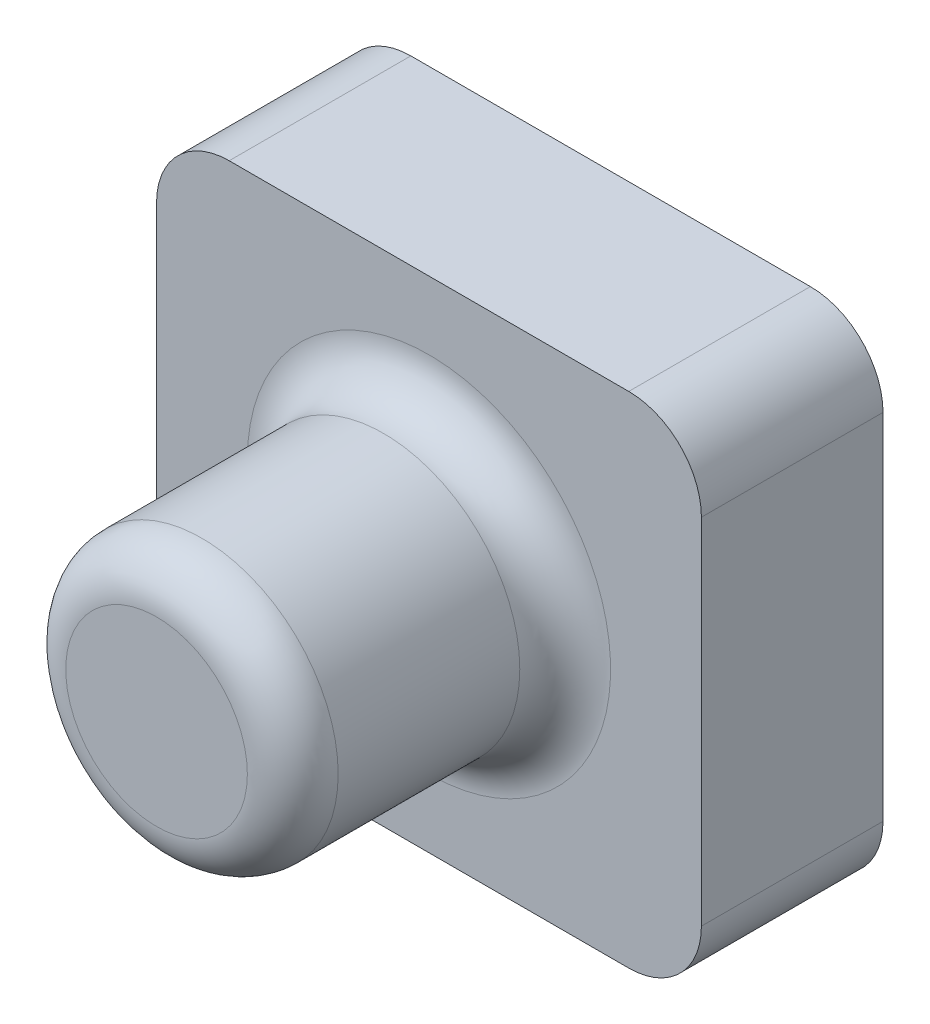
ISO-10303-21;
HEADER;
FILE_DESCRIPTION(('STEP AP214'),'2;1');
FILE_NAME('part.step','',(''),(''),'','','');
FILE_SCHEMA(('AUTOMOTIVE_DESIGN { 1 0 10303 214 1 1 1 1 }'));
ENDSEC;
DATA;
#1=APPLICATION_CONTEXT('core data for automotive mechanical design processes');
#2=APPLICATION_PROTOCOL_DEFINITION('international standard','automotive_design',2000,#1);
#3=PRODUCT_CONTEXT('',#1,'mechanical');
#4=PRODUCT('Part','Part','',(#3));
#5=PRODUCT_RELATED_PRODUCT_CATEGORY('part','',(#4));
#6=PRODUCT_DEFINITION_FORMATION('','',#4);
#7=PRODUCT_DEFINITION_CONTEXT('part definition',#1,'design');
#8=PRODUCT_DEFINITION('design','',#6,#7);
#9=PRODUCT_DEFINITION_SHAPE('','',#8);
#10=(LENGTH_UNIT() NAMED_UNIT(*) SI_UNIT(.MILLI.,.METRE.));
#11=(NAMED_UNIT(*) PLANE_ANGLE_UNIT() SI_UNIT($,.RADIAN.));
#12=(NAMED_UNIT(*) SI_UNIT($,.STERADIAN.) SOLID_ANGLE_UNIT());
#13=UNCERTAINTY_MEASURE_WITH_UNIT(LENGTH_MEASURE(1.E-05),#10,'distance_accuracy_value','');
#14=(GEOMETRIC_REPRESENTATION_CONTEXT(3) GLOBAL_UNCERTAINTY_ASSIGNED_CONTEXT((#13)) GLOBAL_UNIT_ASSIGNED_CONTEXT((#10,
#11,#12)) REPRESENTATION_CONTEXT('',''));
#15=CARTESIAN_POINT('',(0.,0.,0.));
#16=DIRECTION('',(0.,0.,1.));
#17=DIRECTION('',(1.,0.,0.));
#18=AXIS2_PLACEMENT_3D('',#15,#16,#17);
#19=CARTESIAN_POINT('',(0.,55.,0.));
#20=DIRECTION('',(0.,0.,-1.));
#21=DIRECTION('',(-1.,0.,0.));
#22=AXIS2_PLACEMENT_3D('',#19,#20,#21);
#23=PLANE('',#22);
#24=DIRECTION('',(1.,0.,0.));
#25=VECTOR('',#24,1.);
#26=CARTESIAN_POINT('',(0.,0.,0.));
#27=LINE('',#26,#25);
#28=CARTESIAN_POINT('',(8.,0.,0.));
#29=VERTEX_POINT('',#28);
#30=CARTESIAN_POINT('',(52.,0.,0.));
#31=VERTEX_POINT('',#30);
#32=EDGE_CURVE('E233',#29,#31,#27,.T.);
#33=ORIENTED_EDGE('',*,*,#32,.F.);
#34=CARTESIAN_POINT('',(8.,8.,0.));
#35=DIRECTION('',(0.,0.,-1.));
#36=DIRECTION('',(-1.,0.,0.));
#37=AXIS2_PLACEMENT_3D('',#34,#35,#36);
#38=CIRCLE('',#37,8.);
#39=CARTESIAN_POINT('',(0.,8.,0.));
#40=VERTEX_POINT('',#39);
#41=EDGE_CURVE('E250',#29,#40,#38,.T.);
#42=ORIENTED_EDGE('',*,*,#41,.T.);
#43=DIRECTION('',(0.,-1.,0.));
#44=VECTOR('',#43,1.);
#45=CARTESIAN_POINT('',(0.,0.,0.));
#46=LINE('',#45,#44);
#47=CARTESIAN_POINT('',(0.,47.,0.));
#48=VERTEX_POINT('',#47);
#49=EDGE_CURVE('E204',#48,#40,#46,.T.);
#50=ORIENTED_EDGE('',*,*,#49,.F.);
#51=CARTESIAN_POINT('',(8.,47.,0.));
#52=DIRECTION('',(0.,0.,-1.));
#53=DIRECTION('',(-1.,0.,0.));
#54=AXIS2_PLACEMENT_3D('',#51,#52,#53);
#55=CIRCLE('',#54,8.);
#56=CARTESIAN_POINT('',(8.,55.,0.));
#57=VERTEX_POINT('',#56);
#58=EDGE_CURVE('E244',#48,#57,#55,.T.);
#59=ORIENTED_EDGE('',*,*,#58,.T.);
#60=DIRECTION('',(-1.,0.,0.));
#61=VECTOR('',#60,1.);
#62=CARTESIAN_POINT('',(0.,55.,0.));
#63=LINE('',#62,#61);
#64=CARTESIAN_POINT('',(52.,55.,0.));
#65=VERTEX_POINT('',#64);
#66=EDGE_CURVE('E222',#65,#57,#63,.T.);
#67=ORIENTED_EDGE('',*,*,#66,.F.);
#68=CARTESIAN_POINT('',(52.,47.,0.));
#69=DIRECTION('',(0.,0.,-1.));
#70=DIRECTION('',(-1.,0.,0.));
#71=AXIS2_PLACEMENT_3D('',#68,#69,#70);
#72=CIRCLE('',#71,8.);
#73=CARTESIAN_POINT('',(60.,47.,0.));
#74=VERTEX_POINT('',#73);
#75=EDGE_CURVE('E246',#65,#74,#72,.T.);
#76=ORIENTED_EDGE('',*,*,#75,.T.);
#77=DIRECTION('',(0.,1.,0.));
#78=VECTOR('',#77,1.);
#79=CARTESIAN_POINT('',(60.,0.,0.));
#80=LINE('',#79,#78);
#81=CARTESIAN_POINT('',(60.,8.,0.));
#82=VERTEX_POINT('',#81);
#83=EDGE_CURVE('E236',#82,#74,#80,.T.);
#84=ORIENTED_EDGE('',*,*,#83,.F.);
#85=CARTESIAN_POINT('',(52.,8.,0.));
#86=DIRECTION('',(0.,0.,-1.));
#87=DIRECTION('',(-1.,0.,0.));
#88=AXIS2_PLACEMENT_3D('',#85,#86,#87);
#89=CIRCLE('',#88,8.);
#90=EDGE_CURVE('E248',#82,#31,#89,.T.);
#91=ORIENTED_EDGE('',*,*,#90,.T.);
#92=EDGE_LOOP('',(#33,#42,#50,#59,#67,#76,#84,#91));
#93=FACE_BOUND('',#92,.T.);
#94=CARTESIAN_POINT('',(8.,8.,0.));
#95=DIRECTION('',(0.,0.,-1.));
#96=DIRECTION('',(-1.,0.,0.));
#97=AXIS2_PLACEMENT_3D('',#94,#95,#96);
#98=CIRCLE('',#97,5.);
#99=CARTESIAN_POINT('',(8.,3.,0.));
#100=VERTEX_POINT('',#99);
#101=CARTESIAN_POINT('',(3.,8.,0.));
#102=VERTEX_POINT('',#101);
#103=EDGE_CURVE('E215',#100,#102,#98,.T.);
#104=ORIENTED_EDGE('',*,*,#103,.F.);
#105=DIRECTION('',(1.,0.,0.));
#106=VECTOR('',#105,1.);
#107=CARTESIAN_POINT('',(0.,3.,0.));
#108=LINE('',#107,#106);
#109=CARTESIAN_POINT('',(52.,3.,0.));
#110=VERTEX_POINT('',#109);
#111=EDGE_CURVE('E174',#100,#110,#108,.T.);
#112=ORIENTED_EDGE('',*,*,#111,.T.);
#113=CARTESIAN_POINT('',(52.,8.,0.));
#114=DIRECTION('',(0.,0.,-1.));
#115=DIRECTION('',(-1.,0.,0.));
#116=AXIS2_PLACEMENT_3D('',#113,#114,#115);
#117=CIRCLE('',#116,5.);
#118=CARTESIAN_POINT('',(57.,8.,0.));
#119=VERTEX_POINT('',#118);
#120=EDGE_CURVE('E212',#119,#110,#117,.T.);
#121=ORIENTED_EDGE('',*,*,#120,.F.);
#122=DIRECTION('',(0.,1.,0.));
#123=VECTOR('',#122,1.);
#124=CARTESIAN_POINT('',(57.,55.,0.));
#125=LINE('',#124,#123);
#126=CARTESIAN_POINT('',(57.,47.,0.));
#127=VERTEX_POINT('',#126);
#128=EDGE_CURVE('E47',#119,#127,#125,.T.);
#129=ORIENTED_EDGE('',*,*,#128,.T.);
#130=CARTESIAN_POINT('',(52.,47.,0.));
#131=DIRECTION('',(0.,0.,-1.));
#132=DIRECTION('',(-1.,0.,0.));
#133=AXIS2_PLACEMENT_3D('',#130,#131,#132);
#134=CIRCLE('',#133,5.);
#135=CARTESIAN_POINT('',(52.,52.,0.));
#136=VERTEX_POINT('',#135);
#137=EDGE_CURVE('E179',#136,#127,#134,.T.);
#138=ORIENTED_EDGE('',*,*,#137,.F.);
#139=DIRECTION('',(-1.,0.,0.));
#140=VECTOR('',#139,1.);
#141=CARTESIAN_POINT('',(0.,52.,0.));
#142=LINE('',#141,#140);
#143=CARTESIAN_POINT('',(8.,52.,0.));
#144=VERTEX_POINT('',#143);
#145=EDGE_CURVE('E208',#136,#144,#142,.T.);
#146=ORIENTED_EDGE('',*,*,#145,.T.);
#147=CARTESIAN_POINT('',(8.,47.,0.));
#148=DIRECTION('',(0.,0.,-1.));
#149=DIRECTION('',(-1.,0.,0.));
#150=AXIS2_PLACEMENT_3D('',#147,#148,#149);
#151=CIRCLE('',#150,5.);
#152=CARTESIAN_POINT('',(3.,47.,0.));
#153=VERTEX_POINT('',#152);
#154=EDGE_CURVE('E176',#153,#144,#151,.T.);
#155=ORIENTED_EDGE('',*,*,#154,.F.);
#156=DIRECTION('',(0.,-1.,0.));
#157=VECTOR('',#156,1.);
#158=CARTESIAN_POINT('',(3.,55.,0.));
#159=LINE('',#158,#157);
#160=EDGE_CURVE('E205',#153,#102,#159,.T.);
#161=ORIENTED_EDGE('',*,*,#160,.T.);
#162=EDGE_LOOP('',(#104,#112,#121,#129,#138,#146,#155,#161));
#163=FACE_BOUND('',#162,.T.);
#164=ADVANCED_FACE('F32',(#93,#163),#23,.T.);
#165=CARTESIAN_POINT('',(0.,55.,20.));
#166=DIRECTION('',(0.,0.,-1.));
#167=DIRECTION('',(-1.,0.,0.));
#168=AXIS2_PLACEMENT_3D('',#165,#166,#167);
#169=PLANE('',#168);
#170=CARTESIAN_POINT('',(30.,27.5,20.));
#171=DIRECTION('',(0.,0.,-1.));
#172=DIRECTION('',(-1.,0.,0.));
#173=AXIS2_PLACEMENT_3D('',#170,#171,#172);
#174=CIRCLE('',#173,20.);
#175=CARTESIAN_POINT('',(10.,27.5,20.));
#176=VERTEX_POINT('',#175);
#177=EDGE_CURVE('E40',#176,#176,#174,.T.);
#178=ORIENTED_EDGE('',*,*,#177,.T.);
#179=EDGE_LOOP('',(#178));
#180=FACE_BOUND('',#179,.T.);
#181=DIRECTION('',(0.,-1.,0.));
#182=VECTOR('',#181,1.);
#183=CARTESIAN_POINT('',(0.,0.,20.));
#184=LINE('',#183,#182);
#185=CARTESIAN_POINT('',(0.,47.,20.));
#186=VERTEX_POINT('',#185);
#187=CARTESIAN_POINT('',(0.,8.,20.));
#188=VERTEX_POINT('',#187);
#189=EDGE_CURVE('E218',#186,#188,#184,.T.);
#190=ORIENTED_EDGE('',*,*,#189,.T.);
#191=CARTESIAN_POINT('',(8.,8.,20.));
#192=DIRECTION('',(0.,0.,-1.));
#193=DIRECTION('',(-1.,0.,0.));
#194=AXIS2_PLACEMENT_3D('',#191,#192,#193);
#195=CIRCLE('',#194,8.);
#196=CARTESIAN_POINT('',(8.,0.,20.));
#197=VERTEX_POINT('',#196);
#198=EDGE_CURVE('E263',#188,#197,#195,.F.);
#199=ORIENTED_EDGE('',*,*,#198,.T.);
#200=DIRECTION('',(1.,0.,0.));
#201=VECTOR('',#200,1.);
#202=CARTESIAN_POINT('',(0.,0.,20.));
#203=LINE('',#202,#201);
#204=CARTESIAN_POINT('',(52.,0.,20.));
#205=VERTEX_POINT('',#204);
#206=EDGE_CURVE('E221',#197,#205,#203,.T.);
#207=ORIENTED_EDGE('',*,*,#206,.T.);
#208=CARTESIAN_POINT('',(52.,8.,20.));
#209=DIRECTION('',(0.,0.,-1.));
#210=DIRECTION('',(-1.,0.,0.));
#211=AXIS2_PLACEMENT_3D('',#208,#209,#210);
#212=CIRCLE('',#211,8.);
#213=CARTESIAN_POINT('',(60.,8.,20.));
#214=VERTEX_POINT('',#213);
#215=EDGE_CURVE('E261',#205,#214,#212,.F.);
#216=ORIENTED_EDGE('',*,*,#215,.T.);
#217=DIRECTION('',(0.,1.,0.));
#218=VECTOR('',#217,1.);
#219=CARTESIAN_POINT('',(60.,0.,20.));
#220=LINE('',#219,#218);
#221=CARTESIAN_POINT('',(60.,47.,20.));
#222=VERTEX_POINT('',#221);
#223=EDGE_CURVE('E225',#214,#222,#220,.T.);
#224=ORIENTED_EDGE('',*,*,#223,.T.);
#225=CARTESIAN_POINT('',(52.,47.,20.));
#226=DIRECTION('',(0.,0.,-1.));
#227=DIRECTION('',(-1.,0.,0.));
#228=AXIS2_PLACEMENT_3D('',#225,#226,#227);
#229=CIRCLE('',#228,8.);
#230=CARTESIAN_POINT('',(52.,55.,20.));
#231=VERTEX_POINT('',#230);
#232=EDGE_CURVE('E259',#222,#231,#229,.F.);
#233=ORIENTED_EDGE('',*,*,#232,.T.);
#234=DIRECTION('',(-1.,0.,0.));
#235=VECTOR('',#234,1.);
#236=CARTESIAN_POINT('',(0.,55.,20.));
#237=LINE('',#236,#235);
#238=CARTESIAN_POINT('',(8.,55.,20.));
#239=VERTEX_POINT('',#238);
#240=EDGE_CURVE('E228',#231,#239,#237,.T.);
#241=ORIENTED_EDGE('',*,*,#240,.T.);
#242=CARTESIAN_POINT('',(8.,47.,20.));
#243=DIRECTION('',(0.,0.,-1.));
#244=DIRECTION('',(-1.,0.,0.));
#245=AXIS2_PLACEMENT_3D('',#242,#243,#244);
#246=CIRCLE('',#245,8.);
#247=EDGE_CURVE('E257',#239,#186,#246,.F.);
#248=ORIENTED_EDGE('',*,*,#247,.T.);
#249=EDGE_LOOP('',(#190,#199,#207,#216,#224,#233,#241,#248));
#250=FACE_BOUND('',#249,.T.);
#251=ADVANCED_FACE('F282',(#180,#250),#169,.F.);
#252=CARTESIAN_POINT('',(0.,0.,20.));
#253=DIRECTION('',(1.,0.,0.));
#254=DIRECTION('',(0.,0.,-1.));
#255=AXIS2_PLACEMENT_3D('',#252,#253,#254);
#256=PLANE('',#255);
#257=ORIENTED_EDGE('',*,*,#49,.T.);
#258=DIRECTION('',(0.,0.,-1.));
#259=VECTOR('',#258,1.);
#260=CARTESIAN_POINT('',(0.,8.,20.));
#261=LINE('',#260,#259);
#262=EDGE_CURVE('E255',#40,#188,#261,.F.);
#263=ORIENTED_EDGE('',*,*,#262,.T.);
#264=ORIENTED_EDGE('',*,*,#189,.F.);
#265=DIRECTION('',(0.,0.,-1.));
#266=VECTOR('',#265,1.);
#267=CARTESIAN_POINT('',(0.,47.,20.));
#268=LINE('',#267,#266);
#269=EDGE_CURVE('E252',#186,#48,#268,.T.);
#270=ORIENTED_EDGE('',*,*,#269,.T.);
#271=EDGE_LOOP('',(#257,#263,#264,#270));
#272=FACE_BOUND('',#271,.T.);
#273=ADVANCED_FACE('F313',(#272),#256,.F.);
#274=CARTESIAN_POINT('',(0.,0.,20.));
#275=DIRECTION('',(0.,1.,0.));
#276=DIRECTION('',(0.,0.,1.));
#277=AXIS2_PLACEMENT_3D('',#274,#275,#276);
#278=PLANE('',#277);
#279=ORIENTED_EDGE('',*,*,#206,.F.);
#280=DIRECTION('',(0.,0.,-1.));
#281=VECTOR('',#280,1.);
#282=CARTESIAN_POINT('',(8.,0.,20.));
#283=LINE('',#282,#281);
#284=EDGE_CURVE('E241',#197,#29,#283,.T.);
#285=ORIENTED_EDGE('',*,*,#284,.T.);
#286=ORIENTED_EDGE('',*,*,#32,.T.);
#287=DIRECTION('',(0.,0.,-1.));
#288=VECTOR('',#287,1.);
#289=CARTESIAN_POINT('',(52.,0.,20.));
#290=LINE('',#289,#288);
#291=EDGE_CURVE('E230',#31,#205,#290,.F.);
#292=ORIENTED_EDGE('',*,*,#291,.T.);
#293=EDGE_LOOP('',(#279,#285,#286,#292));
#294=FACE_BOUND('',#293,.T.);
#295=ADVANCED_FACE('F325',(#294),#278,.F.);
#296=CARTESIAN_POINT('',(60.,0.,20.));
#297=DIRECTION('',(-1.,0.,0.));
#298=DIRECTION('',(0.,0.,1.));
#299=AXIS2_PLACEMENT_3D('',#296,#297,#298);
#300=PLANE('',#299);
#301=ORIENTED_EDGE('',*,*,#223,.F.);
#302=DIRECTION('',(0.,0.,-1.));
#303=VECTOR('',#302,1.);
#304=CARTESIAN_POINT('',(60.,8.,20.));
#305=LINE('',#304,#303);
#306=EDGE_CURVE('E267',#214,#82,#305,.T.);
#307=ORIENTED_EDGE('',*,*,#306,.T.);
#308=ORIENTED_EDGE('',*,*,#83,.T.);
#309=DIRECTION('',(0.,0.,-1.));
#310=VECTOR('',#309,1.);
#311=CARTESIAN_POINT('',(60.,47.,20.));
#312=LINE('',#311,#310);
#313=EDGE_CURVE('E265',#74,#222,#312,.F.);
#314=ORIENTED_EDGE('',*,*,#313,.T.);
#315=EDGE_LOOP('',(#301,#307,#308,#314));
#316=FACE_BOUND('',#315,.T.);
#317=ADVANCED_FACE('F322',(#316),#300,.F.);
#318=CARTESIAN_POINT('',(0.,55.,20.));
#319=DIRECTION('',(0.,-1.,0.));
#320=DIRECTION('',(0.,0.,-1.));
#321=AXIS2_PLACEMENT_3D('',#318,#319,#320);
#322=PLANE('',#321);
#323=ORIENTED_EDGE('',*,*,#240,.F.);
#324=DIRECTION('',(0.,0.,-1.));
#325=VECTOR('',#324,1.);
#326=CARTESIAN_POINT('',(52.,55.,20.));
#327=LINE('',#326,#325);
#328=EDGE_CURVE('E271',#231,#65,#327,.T.);
#329=ORIENTED_EDGE('',*,*,#328,.T.);
#330=ORIENTED_EDGE('',*,*,#66,.T.);
#331=DIRECTION('',(0.,0.,-1.));
#332=VECTOR('',#331,1.);
#333=CARTESIAN_POINT('',(8.,55.,20.));
#334=LINE('',#333,#332);
#335=EDGE_CURVE('E55',#57,#239,#334,.F.);
#336=ORIENTED_EDGE('',*,*,#335,.T.);
#337=EDGE_LOOP('',(#323,#329,#330,#336));
#338=FACE_BOUND('',#337,.T.);
#339=ADVANCED_FACE('F318',(#338),#322,.F.);
#340=CARTESIAN_POINT('',(8.,8.,20.));
#341=DIRECTION('',(0.,0.,-1.));
#342=DIRECTION('',(-1.,0.,0.));
#343=AXIS2_PLACEMENT_3D('',#340,#341,#342);
#344=CYLINDRICAL_SURFACE('',#343,8.);
#345=ORIENTED_EDGE('',*,*,#198,.F.);
#346=ORIENTED_EDGE('',*,*,#262,.F.);
#347=ORIENTED_EDGE('',*,*,#41,.F.);
#348=ORIENTED_EDGE('',*,*,#284,.F.);
#349=EDGE_LOOP('',(#345,#346,#347,#348));
#350=FACE_BOUND('',#349,.T.);
#351=ADVANCED_FACE('F321',(#350),#344,.T.);
#352=CARTESIAN_POINT('',(52.,8.,20.));
#353=DIRECTION('',(0.,0.,-1.));
#354=DIRECTION('',(-1.,0.,0.));
#355=AXIS2_PLACEMENT_3D('',#352,#353,#354);
#356=CYLINDRICAL_SURFACE('',#355,8.);
#357=ORIENTED_EDGE('',*,*,#215,.F.);
#358=ORIENTED_EDGE('',*,*,#291,.F.);
#359=ORIENTED_EDGE('',*,*,#90,.F.);
#360=ORIENTED_EDGE('',*,*,#306,.F.);
#361=EDGE_LOOP('',(#357,#358,#359,#360));
#362=FACE_BOUND('',#361,.T.);
#363=ADVANCED_FACE('F335',(#362),#356,.T.);
#364=CARTESIAN_POINT('',(52.,47.,20.));
#365=DIRECTION('',(0.,0.,-1.));
#366=DIRECTION('',(-1.,0.,0.));
#367=AXIS2_PLACEMENT_3D('',#364,#365,#366);
#368=CYLINDRICAL_SURFACE('',#367,8.);
#369=ORIENTED_EDGE('',*,*,#232,.F.);
#370=ORIENTED_EDGE('',*,*,#313,.F.);
#371=ORIENTED_EDGE('',*,*,#75,.F.);
#372=ORIENTED_EDGE('',*,*,#328,.F.);
#373=EDGE_LOOP('',(#369,#370,#371,#372));
#374=FACE_BOUND('',#373,.T.);
#375=ADVANCED_FACE('F339',(#374),#368,.T.);
#376=CARTESIAN_POINT('',(8.,47.,20.));
#377=DIRECTION('',(0.,0.,-1.));
#378=DIRECTION('',(-1.,0.,0.));
#379=AXIS2_PLACEMENT_3D('',#376,#377,#378);
#380=CYLINDRICAL_SURFACE('',#379,8.);
#381=ORIENTED_EDGE('',*,*,#247,.F.);
#382=ORIENTED_EDGE('',*,*,#335,.F.);
#383=ORIENTED_EDGE('',*,*,#58,.F.);
#384=ORIENTED_EDGE('',*,*,#269,.F.);
#385=EDGE_LOOP('',(#381,#382,#383,#384));
#386=FACE_BOUND('',#385,.T.);
#387=ADVANCED_FACE('F294',(#386),#380,.T.);
#388=CARTESIAN_POINT('',(30.,27.5,50.));
#389=DIRECTION('',(0.,0.,-1.));
#390=DIRECTION('',(-1.,0.,0.));
#391=AXIS2_PLACEMENT_3D('',#388,#389,#390);
#392=CYLINDRICAL_SURFACE('',#391,15.);
#393=CARTESIAN_POINT('',(30.,27.5,25.));
#394=DIRECTION('',(0.,0.,-1.));
#395=DIRECTION('',(-1.,0.,0.));
#396=AXIS2_PLACEMENT_3D('',#393,#394,#395);
#397=CIRCLE('',#396,15.);
#398=CARTESIAN_POINT('',(15.,27.5,25.));
#399=VERTEX_POINT('',#398);
#400=EDGE_CURVE('E277',#399,#399,#397,.F.);
#401=ORIENTED_EDGE('',*,*,#400,.T.);
#402=EDGE_LOOP('',(#401));
#403=FACE_BOUND('',#402,.T.);
#404=CARTESIAN_POINT('',(30.,27.5,45.));
#405=DIRECTION('',(0.,0.,1.));
#406=DIRECTION('',(1.,0.,0.));
#407=AXIS2_PLACEMENT_3D('',#404,#405,#406);
#408=CIRCLE('',#407,15.);
#409=CARTESIAN_POINT('',(45.,27.5,45.));
#410=VERTEX_POINT('',#409);
#411=EDGE_CURVE('E274',#410,#410,#408,.F.);
#412=ORIENTED_EDGE('',*,*,#411,.T.);
#413=EDGE_LOOP('',(#412));
#414=FACE_BOUND('',#413,.T.);
#415=ADVANCED_FACE('F291',(#403,#414),#392,.T.);
#416=CARTESIAN_POINT('',(30.,27.5,50.));
#417=DIRECTION('',(0.,0.,1.));
#418=DIRECTION('',(1.,0.,0.));
#419=AXIS2_PLACEMENT_3D('',#416,#417,#418);
#420=PLANE('',#419);
#421=CARTESIAN_POINT('',(30.,27.5,50.));
#422=DIRECTION('',(0.,0.,1.));
#423=DIRECTION('',(1.,0.,0.));
#424=AXIS2_PLACEMENT_3D('',#421,#422,#423);
#425=CIRCLE('',#424,9.99999999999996);
#426=CARTESIAN_POINT('',(40.,27.5,50.));
#427=VERTEX_POINT('',#426);
#428=EDGE_CURVE('E11',#427,#427,#425,.T.);
#429=ORIENTED_EDGE('',*,*,#428,.T.);
#430=EDGE_LOOP('',(#429));
#431=FACE_BOUND('',#430,.T.);
#432=ADVANCED_FACE('F288',(#431),#420,.T.);
#433=CARTESIAN_POINT('',(30.,27.5,25.));
#434=DIRECTION('',(0.,0.,-1.));
#435=DIRECTION('',(-1.,0.,0.));
#436=AXIS2_PLACEMENT_3D('',#433,#434,#435);
#437=TOROIDAL_SURFACE('',#436,20.,5.);
#438=ORIENTED_EDGE('',*,*,#177,.F.);
#439=EDGE_LOOP('',(#438));
#440=FACE_BOUND('',#439,.T.);
#441=ORIENTED_EDGE('',*,*,#400,.F.);
#442=EDGE_LOOP('',(#441));
#443=FACE_BOUND('',#442,.T.);
#444=ADVANCED_FACE('F285',(#440,#443),#437,.F.);
#445=CARTESIAN_POINT('',(30.,27.5,45.));
#446=DIRECTION('',(0.,0.,1.));
#447=DIRECTION('',(1.,0.,0.));
#448=AXIS2_PLACEMENT_3D('',#445,#446,#447);
#449=TOROIDAL_SURFACE('',#448,9.99999999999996,5.);
#450=ORIENTED_EDGE('',*,*,#411,.F.);
#451=EDGE_LOOP('',(#450));
#452=FACE_BOUND('',#451,.T.);
#453=ORIENTED_EDGE('',*,*,#428,.F.);
#454=EDGE_LOOP('',(#453));
#455=FACE_BOUND('',#454,.T.);
#456=ADVANCED_FACE('F34',(#452,#455),#449,.T.);
#457=CARTESIAN_POINT('',(0.,55.,17.));
#458=DIRECTION('',(0.,0.,-1.));
#459=DIRECTION('',(-1.,0.,0.));
#460=AXIS2_PLACEMENT_3D('',#457,#458,#459);
#461=PLANE('',#460);
#462=CARTESIAN_POINT('',(30.,27.5,17.));
#463=DIRECTION('',(0.,0.,-1.));
#464=DIRECTION('',(-1.,0.,0.));
#465=AXIS2_PLACEMENT_3D('',#462,#463,#464);
#466=CIRCLE('',#465,20.);
#467=CARTESIAN_POINT('',(10.,27.5,17.));
#468=VERTEX_POINT('',#467);
#469=EDGE_CURVE('E198',#468,#468,#466,.T.);
#470=ORIENTED_EDGE('',*,*,#469,.F.);
#471=EDGE_LOOP('',(#470));
#472=FACE_BOUND('',#471,.T.);
#473=DIRECTION('',(0.,-1.,0.));
#474=VECTOR('',#473,1.);
#475=CARTESIAN_POINT('',(3.,55.,17.));
#476=LINE('',#475,#474);
#477=CARTESIAN_POINT('',(3.,47.,17.));
#478=VERTEX_POINT('',#477);
#479=CARTESIAN_POINT('',(3.,8.,17.));
#480=VERTEX_POINT('',#479);
#481=EDGE_CURVE('E170',#478,#480,#476,.T.);
#482=ORIENTED_EDGE('',*,*,#481,.F.);
#483=CARTESIAN_POINT('',(8.,47.,17.));
#484=DIRECTION('',(0.,0.,-1.));
#485=DIRECTION('',(-1.,0.,0.));
#486=AXIS2_PLACEMENT_3D('',#483,#484,#485);
#487=CIRCLE('',#486,5.);
#488=CARTESIAN_POINT('',(8.,52.,17.));
#489=VERTEX_POINT('',#488);
#490=EDGE_CURVE('E541',#489,#478,#487,.F.);
#491=ORIENTED_EDGE('',*,*,#490,.F.);
#492=DIRECTION('',(-1.,0.,0.));
#493=VECTOR('',#492,1.);
#494=CARTESIAN_POINT('',(0.,52.,17.));
#495=LINE('',#494,#493);
#496=CARTESIAN_POINT('',(52.,52.,17.));
#497=VERTEX_POINT('',#496);
#498=EDGE_CURVE('E181',#497,#489,#495,.T.);
#499=ORIENTED_EDGE('',*,*,#498,.F.);
#500=CARTESIAN_POINT('',(52.,47.,17.));
#501=DIRECTION('',(0.,0.,-1.));
#502=DIRECTION('',(-1.,0.,0.));
#503=AXIS2_PLACEMENT_3D('',#500,#501,#502);
#504=CIRCLE('',#503,5.);
#505=CARTESIAN_POINT('',(57.,47.,17.));
#506=VERTEX_POINT('',#505);
#507=EDGE_CURVE('E537',#506,#497,#504,.F.);
#508=ORIENTED_EDGE('',*,*,#507,.F.);
#509=DIRECTION('',(0.,1.,0.));
#510=VECTOR('',#509,1.);
#511=CARTESIAN_POINT('',(57.,55.,17.));
#512=LINE('',#511,#510);
#513=CARTESIAN_POINT('',(57.,8.,17.));
#514=VERTEX_POINT('',#513);
#515=EDGE_CURVE('E169',#514,#506,#512,.T.);
#516=ORIENTED_EDGE('',*,*,#515,.F.);
#517=CARTESIAN_POINT('',(52.,8.,17.));
#518=DIRECTION('',(0.,0.,-1.));
#519=DIRECTION('',(-1.,0.,0.));
#520=AXIS2_PLACEMENT_3D('',#517,#518,#519);
#521=CIRCLE('',#520,5.);
#522=CARTESIAN_POINT('',(52.,3.,17.));
#523=VERTEX_POINT('',#522);
#524=EDGE_CURVE('E160',#523,#514,#521,.F.);
#525=ORIENTED_EDGE('',*,*,#524,.F.);
#526=DIRECTION('',(1.,0.,0.));
#527=VECTOR('',#526,1.);
#528=CARTESIAN_POINT('',(0.,3.,17.));
#529=LINE('',#528,#527);
#530=CARTESIAN_POINT('',(8.,3.,17.));
#531=VERTEX_POINT('',#530);
#532=EDGE_CURVE('E164',#531,#523,#529,.T.);
#533=ORIENTED_EDGE('',*,*,#532,.F.);
#534=CARTESIAN_POINT('',(8.,8.,17.));
#535=DIRECTION('',(0.,0.,-1.));
#536=DIRECTION('',(-1.,0.,0.));
#537=AXIS2_PLACEMENT_3D('',#534,#535,#536);
#538=CIRCLE('',#537,5.);
#539=EDGE_CURVE('E148',#480,#531,#538,.F.);
#540=ORIENTED_EDGE('',*,*,#539,.F.);
#541=EDGE_LOOP('',(#482,#491,#499,#508,#516,#525,#533,#540));
#542=FACE_BOUND('',#541,.T.);
#543=ADVANCED_FACE('F165',(#472,#542),#461,.T.);
#544=CARTESIAN_POINT('',(3.,0.,20.));
#545=DIRECTION('',(1.,0.,0.));
#546=DIRECTION('',(0.,0.,-1.));
#547=AXIS2_PLACEMENT_3D('',#544,#545,#546);
#548=PLANE('',#547);
#549=ORIENTED_EDGE('',*,*,#160,.F.);
#550=DIRECTION('',(0.,0.,-1.));
#551=VECTOR('',#550,1.);
#552=CARTESIAN_POINT('',(3.,47.,20.));
#553=LINE('',#552,#551);
#554=EDGE_CURVE('E184',#478,#153,#553,.T.);
#555=ORIENTED_EDGE('',*,*,#554,.F.);
#556=ORIENTED_EDGE('',*,*,#481,.T.);
#557=DIRECTION('',(0.,0.,-1.));
#558=VECTOR('',#557,1.);
#559=CARTESIAN_POINT('',(3.,8.,20.));
#560=LINE('',#559,#558);
#561=EDGE_CURVE('E155',#102,#480,#560,.F.);
#562=ORIENTED_EDGE('',*,*,#561,.F.);
#563=EDGE_LOOP('',(#549,#555,#556,#562));
#564=FACE_BOUND('',#563,.T.);
#565=ADVANCED_FACE('F404',(#564),#548,.T.);
#566=CARTESIAN_POINT('',(0.,3.,20.));
#567=DIRECTION('',(0.,1.,0.));
#568=DIRECTION('',(0.,0.,1.));
#569=AXIS2_PLACEMENT_3D('',#566,#567,#568);
#570=PLANE('',#569);
#571=ORIENTED_EDGE('',*,*,#532,.T.);
#572=DIRECTION('',(0.,0.,1.));
#573=VECTOR('',#572,1.);
#574=CARTESIAN_POINT('',(52.,3.,20.));
#575=LINE('',#574,#573);
#576=EDGE_CURVE('E177',#110,#523,#575,.T.);
#577=ORIENTED_EDGE('',*,*,#576,.F.);
#578=ORIENTED_EDGE('',*,*,#111,.F.);
#579=DIRECTION('',(0.,0.,1.));
#580=VECTOR('',#579,1.);
#581=CARTESIAN_POINT('',(8.,3.,20.));
#582=LINE('',#581,#580);
#583=EDGE_CURVE('E152',#531,#100,#582,.F.);
#584=ORIENTED_EDGE('',*,*,#583,.F.);
#585=EDGE_LOOP('',(#571,#577,#578,#584));
#586=FACE_BOUND('',#585,.T.);
#587=ADVANCED_FACE('F172',(#586),#570,.T.);
#588=CARTESIAN_POINT('',(57.,0.,20.));
#589=DIRECTION('',(-1.,0.,0.));
#590=DIRECTION('',(0.,0.,1.));
#591=AXIS2_PLACEMENT_3D('',#588,#589,#590);
#592=PLANE('',#591);
#593=ORIENTED_EDGE('',*,*,#515,.T.);
#594=DIRECTION('',(0.,0.,1.));
#595=VECTOR('',#594,1.);
#596=CARTESIAN_POINT('',(57.,47.,20.));
#597=LINE('',#596,#595);
#598=EDGE_CURVE('E159',#127,#506,#597,.T.);
#599=ORIENTED_EDGE('',*,*,#598,.F.);
#600=ORIENTED_EDGE('',*,*,#128,.F.);
#601=DIRECTION('',(0.,0.,1.));
#602=VECTOR('',#601,1.);
#603=CARTESIAN_POINT('',(57.,8.,20.));
#604=LINE('',#603,#602);
#605=EDGE_CURVE('E187',#514,#119,#604,.F.);
#606=ORIENTED_EDGE('',*,*,#605,.F.);
#607=EDGE_LOOP('',(#593,#599,#600,#606));
#608=FACE_BOUND('',#607,.T.);
#609=ADVANCED_FACE('F423',(#608),#592,.T.);
#610=CARTESIAN_POINT('',(0.,52.,20.));
#611=DIRECTION('',(0.,-1.,0.));
#612=DIRECTION('',(0.,0.,-1.));
#613=AXIS2_PLACEMENT_3D('',#610,#611,#612);
#614=PLANE('',#613);
#615=ORIENTED_EDGE('',*,*,#498,.T.);
#616=DIRECTION('',(0.,0.,-1.));
#617=VECTOR('',#616,1.);
#618=CARTESIAN_POINT('',(8.,52.,20.));
#619=LINE('',#618,#617);
#620=EDGE_CURVE('E189',#144,#489,#619,.F.);
#621=ORIENTED_EDGE('',*,*,#620,.F.);
#622=ORIENTED_EDGE('',*,*,#145,.F.);
#623=DIRECTION('',(0.,0.,-1.));
#624=VECTOR('',#623,1.);
#625=CARTESIAN_POINT('',(52.,52.,20.));
#626=LINE('',#625,#624);
#627=EDGE_CURVE('E191',#497,#136,#626,.T.);
#628=ORIENTED_EDGE('',*,*,#627,.F.);
#629=EDGE_LOOP('',(#615,#621,#622,#628));
#630=FACE_BOUND('',#629,.T.);
#631=ADVANCED_FACE('F432',(#630),#614,.T.);
#632=CARTESIAN_POINT('',(8.,8.,20.));
#633=DIRECTION('',(0.,0.,-1.));
#634=DIRECTION('',(-1.,0.,0.));
#635=AXIS2_PLACEMENT_3D('',#632,#633,#634);
#636=CYLINDRICAL_SURFACE('',#635,5.);
#637=ORIENTED_EDGE('',*,*,#539,.T.);
#638=ORIENTED_EDGE('',*,*,#583,.T.);
#639=ORIENTED_EDGE('',*,*,#103,.T.);
#640=ORIENTED_EDGE('',*,*,#561,.T.);
#641=EDGE_LOOP('',(#637,#638,#639,#640));
#642=FACE_BOUND('',#641,.T.);
#643=ADVANCED_FACE('F150',(#642),#636,.F.);
#644=CARTESIAN_POINT('',(52.,8.,20.));
#645=DIRECTION('',(0.,0.,-1.));
#646=DIRECTION('',(-1.,0.,0.));
#647=AXIS2_PLACEMENT_3D('',#644,#645,#646);
#648=CYLINDRICAL_SURFACE('',#647,5.);
#649=ORIENTED_EDGE('',*,*,#524,.T.);
#650=ORIENTED_EDGE('',*,*,#605,.T.);
#651=ORIENTED_EDGE('',*,*,#120,.T.);
#652=ORIENTED_EDGE('',*,*,#576,.T.);
#653=EDGE_LOOP('',(#649,#650,#651,#652));
#654=FACE_BOUND('',#653,.T.);
#655=ADVANCED_FACE('F450',(#654),#648,.F.);
#656=CARTESIAN_POINT('',(52.,47.,20.));
#657=DIRECTION('',(0.,0.,-1.));
#658=DIRECTION('',(-1.,0.,0.));
#659=AXIS2_PLACEMENT_3D('',#656,#657,#658);
#660=CYLINDRICAL_SURFACE('',#659,5.);
#661=ORIENTED_EDGE('',*,*,#507,.T.);
#662=ORIENTED_EDGE('',*,*,#627,.T.);
#663=ORIENTED_EDGE('',*,*,#137,.T.);
#664=ORIENTED_EDGE('',*,*,#598,.T.);
#665=EDGE_LOOP('',(#661,#662,#663,#664));
#666=FACE_BOUND('',#665,.T.);
#667=ADVANCED_FACE('F459',(#666),#660,.F.);
#668=CARTESIAN_POINT('',(8.,47.,20.));
#669=DIRECTION('',(0.,0.,-1.));
#670=DIRECTION('',(-1.,0.,0.));
#671=AXIS2_PLACEMENT_3D('',#668,#669,#670);
#672=CYLINDRICAL_SURFACE('',#671,5.);
#673=ORIENTED_EDGE('',*,*,#490,.T.);
#674=ORIENTED_EDGE('',*,*,#554,.T.);
#675=ORIENTED_EDGE('',*,*,#154,.T.);
#676=ORIENTED_EDGE('',*,*,#620,.T.);
#677=EDGE_LOOP('',(#673,#674,#675,#676));
#678=FACE_BOUND('',#677,.T.);
#679=ADVANCED_FACE('F469',(#678),#672,.F.);
#680=CARTESIAN_POINT('',(30.,27.5,50.));
#681=DIRECTION('',(0.,0.,-1.));
#682=DIRECTION('',(-1.,0.,0.));
#683=AXIS2_PLACEMENT_3D('',#680,#681,#682);
#684=CYLINDRICAL_SURFACE('',#683,12.);
#685=CARTESIAN_POINT('',(30.,27.5,25.));
#686=DIRECTION('',(0.,0.,-1.));
#687=DIRECTION('',(-1.,0.,0.));
#688=AXIS2_PLACEMENT_3D('',#685,#686,#687);
#689=CIRCLE('',#688,12.);
#690=CARTESIAN_POINT('',(18.,27.5,25.));
#691=VERTEX_POINT('',#690);
#692=EDGE_CURVE('E195',#691,#691,#689,.F.);
#693=ORIENTED_EDGE('',*,*,#692,.F.);
#694=EDGE_LOOP('',(#693));
#695=FACE_BOUND('',#694,.T.);
#696=CARTESIAN_POINT('',(30.,27.5,45.));
#697=DIRECTION('',(0.,0.,-1.));
#698=DIRECTION('',(-1.,0.,0.));
#699=AXIS2_PLACEMENT_3D('',#696,#697,#698);
#700=CIRCLE('',#699,12.);
#701=CARTESIAN_POINT('',(18.,27.5,45.));
#702=VERTEX_POINT('',#701);
#703=EDGE_CURVE('E193',#702,#702,#700,.T.);
#704=ORIENTED_EDGE('',*,*,#703,.F.);
#705=EDGE_LOOP('',(#704));
#706=FACE_BOUND('',#705,.T.);
#707=ADVANCED_FACE('F479',(#695,#706),#684,.F.);
#708=CARTESIAN_POINT('',(30.,27.5,47.));
#709=DIRECTION('',(0.,0.,1.));
#710=DIRECTION('',(1.,0.,0.));
#711=AXIS2_PLACEMENT_3D('',#708,#709,#710);
#712=PLANE('',#711);
#713=CARTESIAN_POINT('',(30.,27.5,47.));
#714=DIRECTION('',(0.,0.,1.));
#715=DIRECTION('',(1.,0.,0.));
#716=AXIS2_PLACEMENT_3D('',#713,#714,#715);
#717=CIRCLE('',#716,9.99999999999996);
#718=CARTESIAN_POINT('',(40.,27.5,47.));
#719=VERTEX_POINT('',#718);
#720=EDGE_CURVE('E201',#719,#719,#717,.T.);
#721=ORIENTED_EDGE('',*,*,#720,.F.);
#722=EDGE_LOOP('',(#721));
#723=FACE_BOUND('',#722,.T.);
#724=ADVANCED_FACE('F489',(#723),#712,.F.);
#725=CARTESIAN_POINT('',(30.,27.5,25.));
#726=DIRECTION('',(0.,0.,-1.));
#727=DIRECTION('',(-1.,0.,0.));
#728=AXIS2_PLACEMENT_3D('',#725,#726,#727);
#729=TOROIDAL_SURFACE('',#728,20.,8.);
#730=ORIENTED_EDGE('',*,*,#469,.T.);
#731=EDGE_LOOP('',(#730));
#732=FACE_BOUND('',#731,.T.);
#733=ORIENTED_EDGE('',*,*,#692,.T.);
#734=EDGE_LOOP('',(#733));
#735=FACE_BOUND('',#734,.T.);
#736=ADVANCED_FACE('F499',(#732,#735),#729,.T.);
#737=CARTESIAN_POINT('',(30.,27.5,45.));
#738=DIRECTION('',(0.,0.,1.));
#739=DIRECTION('',(1.,0.,0.));
#740=AXIS2_PLACEMENT_3D('',#737,#738,#739);
#741=TOROIDAL_SURFACE('',#740,9.99999999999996,2.);
#742=ORIENTED_EDGE('',*,*,#703,.T.);
#743=EDGE_LOOP('',(#742));
#744=FACE_BOUND('',#743,.T.);
#745=ORIENTED_EDGE('',*,*,#720,.T.);
#746=EDGE_LOOP('',(#745));
#747=FACE_BOUND('',#746,.T.);
#748=ADVANCED_FACE('F510',(#744,#747),#741,.F.);
#749=CLOSED_SHELL('',(#164,#251,#273,#295,#317,#339,#351,#363,#375,#387,#415,#432,#444,#456,
#543,#565,#587,#609,#631,#643,#655,#667,#679,#707,#724,#736,#748));
#750=MANIFOLD_SOLID_BREP('B2',#749);
#751=ADVANCED_BREP_SHAPE_REPRESENTATION('',(#18,#750),#14);
#752=SHAPE_DEFINITION_REPRESENTATION(#9,#751);
ENDSEC;
END-ISO-10303-21;
